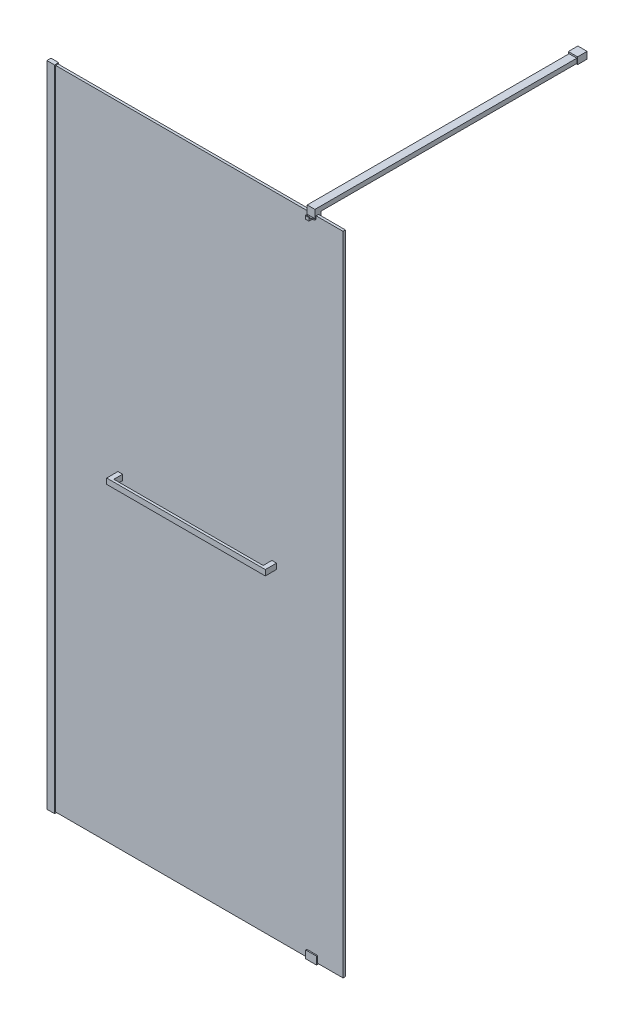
from build123d import *

# Parameters (mm, degrees)
DODANIE_WYCI_GNI_CIE1_DEPTH     = 2100
SZKIC2_W                        = 947
SZKIC2_H                        = 8
DODANIE_WYCI_GNI_CIE2_DEPTH     = 2100
SZKIC4_W                        = 25
SZKIC4_H                        = 13.3
DODANIE_WYCI_GNI_CIE3_DEPTH     = 3
SZKIC5_W                        = 25
SZKIC5_H                        = 13.3
DODANIE_WYCI_GNI_CIE4_DEPTH     = 3
DODANIE_WYCI_GNI_CIE5_DEPTH     = 17.5
DODANIE_WYCI_GNI_CIE6_DEPTH     = 12.5
WYTNIJ_WYCI_GNI_CIE1_DEPTH      = 2312.192714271
WYTNIJ_WYCI_GNI_CIE1_DEPTH_BACK = 2312.192714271
SZKIC10_W                       = 25
SZKIC10_H                       = 861.63
DODANIE_WYCI_GNI_CIE7_DEPTH     = 15
SZKIC14_W                       = 30
SZKIC14_H                       = 22
DODANIE_WYCI_GNI_CIE8_DEPTH     = 31
POLKA_1A_DEPTH                  = 36.5
POLKA_1A_DEPTH_BACK             = 31
SZKIC17_W                       = 15
SZKIC17_H                       = 18
POLKA_1A_2_DEPTH                = 36.5
POLKA_1A_2_DEPTH_BACK           = 31
POLKA_1B_START                  = -515
SZKIC18_W                       = 12.8
SZKIC18_H                       = 8
POLKA_1B_DEPTH                  = 515
POLKA_1C_START                  = -5.28
SZKIC19_W                       = 515
SZKIC19_H                       = 80
POLKA_1C_DEPTH                  = 8
SZKIC20_W                       = 8
SZKIC20_H                       = 18
POLKA_1D_DEPTH                  = 485


with BuildPart() as part:
    # Szkic1 → Dodanie-wyci_gni_cie1 (new body)
    with BuildSketch(Plane(origin=(0, 0, 0), x_dir=(1, 0, 0), z_dir=(0, 1, 0))):
        Polygon((0, 0), (0, 13.3), (25, 13.3), (25, 11.4), (11.45, 11.4), (11.45, 3.4), (25, 3.4), (25, 0), align=None)
    extrude(amount=DODANIE_WYCI_GNI_CIE1_DEPTH)

    # Szkic4 → Dodanie-wyci_gni_cie3 (add)
    with BuildSketch(Plane(origin=(0, 2100, 0), x_dir=(1, 0, 0), z_dir=(0, 1, 0))):
        with Locations((12.5, 6.65)):
            Rectangle(SZKIC4_W, SZKIC4_H)
    extrude(amount=DODANIE_WYCI_GNI_CIE3_DEPTH)

    # Szkic5 → Dodanie-wyci_gni_cie4 (add)
    with BuildSketch(Plane.XZ):
        with Locations((12.5, -6.65)):
            Rectangle(SZKIC5_W, SZKIC5_H)
    extrude(amount=DODANIE_WYCI_GNI_CIE4_DEPTH)


with BuildPart() as body_2:
    # Szkic2 → Dodanie-wyci_gni_cie2 (new body)
    with BuildSketch(Plane.XZ):
        with Locations((484.95, -7.4)):
            Rectangle(SZKIC2_W, SZKIC2_H)
    extrude(amount=-DODANIE_WYCI_GNI_CIE2_DEPTH)


with BuildPart() as body_3:
    # Szkic6 → Dodanie-wyci_gni_cie5 (new, symmetric)
    with BuildSketch(Plane(origin=(858.45, 0, 0), x_dir=(0, 0, -1), z_dir=(1, 0, 0))):
        Polygon((11.4, 22), (15.75, 22), (15.75, -3), (-0.35, -3), (-0.35, 22), (3.4, 22), (3.4, 0), (11.4, 0), align=None)
    extrude(amount=DODANIE_WYCI_GNI_CIE5_DEPTH, both=True)


with BuildPart() as body_4:
    # Szkic7 → Dodanie-wyci_gni_cie6 (new, symmetric)
    with BuildSketch(Plane(origin=(858.45, 0, 0), x_dir=(0, 0, -1), z_dir=(1, 0, 0))):
        Polygon((-0.6, 2120), (19.4, 2120), (19.4, 2090), (11.4, 2090), (11.4, 2100), (3.4, 2100), (3.4, 2090), (-13.37, 2090), (-13.37, 2100), (-10.37, 2100), (-9.845068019, 2094), (-0.6, 2094), align=None)
    extrude(amount=DODANIE_WYCI_GNI_CIE6_DEPTH, both=True)

    # Szkic8 → Wytnij-wyci_gni_cie1 (cut, two sides: drawn at the far end of the back side and taken through both)
    with BuildSketch(Plane(origin=(0, 2100, 0), x_dir=(1, 0, 0), z_dir=(0, 1, 0)).offset(-WYTNIJ_WYCI_GNI_CIE1_DEPTH_BACK)):
        Polygon((-742.226795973, 739.979002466), (845.95, -0.6), (852.45, -3.630999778), (852.45, -13.37), (864.45, -13.37), (864.45, -3.630999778), (870.95, -0.6), (2459.126795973, 739.979002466), (2459.126795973, -2764.739413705), (-742.226795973, -2764.739413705), align=None)
    extrude(amount=WYTNIJ_WYCI_GNI_CIE1_DEPTH + WYTNIJ_WYCI_GNI_CIE1_DEPTH_BACK, mode=Mode.SUBTRACT)

    # Szkic10 → Dodanie-wyci_gni_cie7 (add)
    with BuildSketch(Plane(origin=(0, 2120, 0), x_dir=(1, 0, 0), z_dir=(0, 1, 0))):
        with Locations((858.45, 450.215)):
            Rectangle(SZKIC10_W, SZKIC10_H)
    extrude(amount=-DODANIE_WYCI_GNI_CIE7_DEPTH)

    # Szkic14 → Dodanie-wyci_gni_cie8 (add)
    with BuildSketch(Plane(origin=(0, 0, -881.03), x_dir=(-1, 0, 0), z_dir=(0, 0, -1))):
        with Locations((-858.45, 2114)):
            Rectangle(SZKIC14_W, SZKIC14_H)
    extrude(amount=-DODANIE_WYCI_GNI_CIE8_DEPTH)


with BuildPart() as body_5:
    # Szkic17 → polka_1a (new, two sides: drawn at the far end of the back side and taken through both)
    with BuildSketch(Plane.XY.offset(-3.4).offset(-POLKA_1A_DEPTH_BACK)):
        with Locations((234.95, 1050)):
            Rectangle(SZKIC17_W, SZKIC17_H)
    extrude(amount=POLKA_1A_DEPTH + POLKA_1A_DEPTH_BACK)


with BuildPart() as body_6:
    # Szkic17 → polka_1a 2 (new, two sides: drawn at the far end of the back side and taken through both)
    with BuildSketch(Plane.XY.offset(-3.4).offset(-POLKA_1A_2_DEPTH_BACK)):
        with Locations((734.95, 1050)):
            Rectangle(SZKIC17_W, SZKIC17_H)
    extrude(amount=POLKA_1A_2_DEPTH + POLKA_1A_2_DEPTH_BACK)


with BuildPart() as polka_1b_tool:
    # Szkic18 → polka_1b (new body)
    with BuildSketch(Plane.ZY.offset(-227.45).offset(POLKA_1B_START)):
        with Locations((-28, 1049.73)):
            Rectangle(SZKIC18_W, SZKIC18_H)
    extrude(amount=POLKA_1B_DEPTH)


with BuildPart() as body_5_1:
    add(body_5.part)

    # polka_1b: cut by polka_1b_tool
    add(polka_1b_tool.part, mode=Mode.SUBTRACT)



with BuildPart() as body_6_1:
    add(body_6.part)

    # polka_1b: cut by polka_1b_tool
    add(polka_1b_tool.part, mode=Mode.SUBTRACT)


with BuildPart() as body_7:
    # Szkic19 → polka_1c (new body)
    with BuildSketch(Plane(origin=(0, 1059, 0), x_dir=(1, 0, 0), z_dir=(0, 1, 0)).offset(POLKA_1C_START)):
        with Locations((484.95, 61.6)):
            Rectangle(SZKIC19_W, SZKIC19_H)
    extrude(amount=-POLKA_1C_DEPTH)


with BuildPart() as body_5_2:
    add(body_5_1.part)

    add(body_6_1.part)  # polka_1d merges body 6
    # Szkic20 → polka_1d (add)
    with BuildSketch(Plane(origin=(242.45, 0, 0), x_dir=(0, 0, -1), z_dir=(1, 0, 0))):
        with Locations((-29.1, 1050)):
            Rectangle(SZKIC20_W, SZKIC20_H)
    extrude(amount=POLKA_1D_DEPTH)


solid = Compound([part.part, body_2.part, body_3.part, body_4.part, body_7.part, body_5_2.part])
